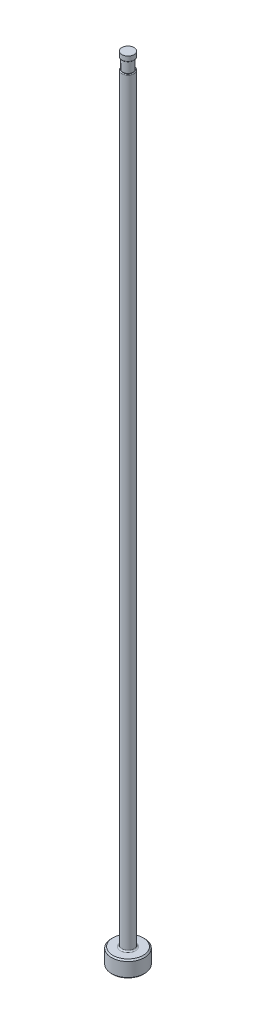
ISO-10303-21;
HEADER;
FILE_DESCRIPTION(('STEP AP214'),'2;1');
FILE_NAME('part.step','',(''),(''),'','','');
FILE_SCHEMA(('AUTOMOTIVE_DESIGN { 1 0 10303 214 1 1 1 1 }'));
ENDSEC;
DATA;
#1=APPLICATION_CONTEXT('core data for automotive mechanical design processes');
#2=APPLICATION_PROTOCOL_DEFINITION('international standard','automotive_design',2000,#1);
#3=PRODUCT_CONTEXT('',#1,'mechanical');
#4=PRODUCT('Part','Part','',(#3));
#5=PRODUCT_RELATED_PRODUCT_CATEGORY('part','',(#4));
#6=PRODUCT_DEFINITION_FORMATION('','',#4);
#7=PRODUCT_DEFINITION_CONTEXT('part definition',#1,'design');
#8=PRODUCT_DEFINITION('design','',#6,#7);
#9=PRODUCT_DEFINITION_SHAPE('','',#8);
#10=(LENGTH_UNIT() NAMED_UNIT(*) SI_UNIT(.MILLI.,.METRE.));
#11=(NAMED_UNIT(*) PLANE_ANGLE_UNIT() SI_UNIT($,.RADIAN.));
#12=(NAMED_UNIT(*) SI_UNIT($,.STERADIAN.) SOLID_ANGLE_UNIT());
#13=UNCERTAINTY_MEASURE_WITH_UNIT(LENGTH_MEASURE(1.E-05),#10,'distance_accuracy_value','');
#14=(GEOMETRIC_REPRESENTATION_CONTEXT(3) GLOBAL_UNCERTAINTY_ASSIGNED_CONTEXT((#13)) GLOBAL_UNIT_ASSIGNED_CONTEXT((#10,
#11,#12)) REPRESENTATION_CONTEXT('',''));
#15=CARTESIAN_POINT('',(0.,0.,0.));
#16=DIRECTION('',(0.,0.,1.));
#17=DIRECTION('',(1.,0.,0.));
#18=AXIS2_PLACEMENT_3D('',#15,#16,#17);
#19=CARTESIAN_POINT('',(-1.18998999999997,151.384,0.));
#20=DIRECTION('',(0.,1.,0.));
#21=DIRECTION('',(0.,0.,1.));
#22=AXIS2_PLACEMENT_3D('',#19,#20,#21);
#23=PLANE('',#22);
#24=CARTESIAN_POINT('',(0.,151.384,0.));
#25=DIRECTION('',(0.,1.,0.));
#26=DIRECTION('',(0.,0.,1.));
#27=AXIS2_PLACEMENT_3D('',#24,#25,#26);
#28=CIRCLE('',#27,1.05790999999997);
#29=CARTESIAN_POINT('',(0.,151.384,1.05790999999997));
#30=VERTEX_POINT('',#29);
#31=EDGE_CURVE('E11',#30,#30,#28,.F.);
#32=ORIENTED_EDGE('',*,*,#31,.T.);
#33=EDGE_LOOP('',(#32));
#34=FACE_BOUND('',#33,.T.);
#35=CARTESIAN_POINT('',(0.,151.384,0.));
#36=DIRECTION('',(0.,1.,0.));
#37=DIRECTION('',(0.,0.,1.));
#38=AXIS2_PLACEMENT_3D('',#35,#36,#37);
#39=CIRCLE('',#38,0.986789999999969);
#40=CARTESIAN_POINT('',(0.,151.384,0.986789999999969));
#41=VERTEX_POINT('',#40);
#42=EDGE_CURVE('E78',#41,#41,#39,.T.);
#43=ORIENTED_EDGE('',*,*,#42,.T.);
#44=EDGE_LOOP('',(#43));
#45=FACE_BOUND('',#44,.T.);
#46=ADVANCED_FACE('F36',(#34,#45),#23,.F.);
#47=CARTESIAN_POINT('',(0.,259.958771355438,0.));
#48=DIRECTION('',(0.,1.,0.));
#49=DIRECTION('',(0.,0.,1.));
#50=AXIS2_PLACEMENT_3D('',#47,#48,#49);
#51=CYLINDRICAL_SURFACE('',#50,1.18998999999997);
#52=DIRECTION('',(0.,1.,0.));
#53=VECTOR('',#52,1.);
#54=CARTESIAN_POINT('',(-0.986789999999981,259.958771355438,-0.665072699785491));
#55=LINE('',#54,#53);
#56=CARTESIAN_POINT('',(-0.986789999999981,149.225,-0.665072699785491));
#57=VERTEX_POINT('',#56);
#58=CARTESIAN_POINT('',(-0.986789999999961,86.868,-0.665072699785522));
#59=VERTEX_POINT('',#58);
#60=EDGE_CURVE('E73',#57,#59,#55,.F.);
#61=ORIENTED_EDGE('',*,*,#60,.F.);
#62=CARTESIAN_POINT('',(0.,149.225,0.));
#63=DIRECTION('',(0.,-1.,0.));
#64=DIRECTION('',(0.,0.,-1.));
#65=AXIS2_PLACEMENT_3D('',#62,#63,#64);
#66=CIRCLE('',#65,1.18998999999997);
#67=CARTESIAN_POINT('',(-0.986789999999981,149.225,0.665072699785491));
#68=VERTEX_POINT('',#67);
#69=EDGE_CURVE('E51',#57,#68,#66,.T.);
#70=ORIENTED_EDGE('',*,*,#69,.T.);
#71=DIRECTION('',(0.,1.,0.));
#72=VECTOR('',#71,1.);
#73=CARTESIAN_POINT('',(-0.986789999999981,259.958771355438,0.665072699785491));
#74=LINE('',#73,#72);
#75=CARTESIAN_POINT('',(-0.986789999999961,86.868,0.665072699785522));
#76=VERTEX_POINT('',#75);
#77=EDGE_CURVE('E84',#76,#68,#74,.T.);
#78=ORIENTED_EDGE('',*,*,#77,.F.);
#79=CARTESIAN_POINT('',(-0.98678999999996,86.868,-0.665072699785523));
#80=CARTESIAN_POINT('',(-0.986779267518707,86.817745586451,-0.66504129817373));
#81=CARTESIAN_POINT('',(-0.987982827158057,86.7674764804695,-0.663300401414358));
#82=CARTESIAN_POINT('',(-0.992752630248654,86.6671549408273,-0.656166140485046));
#83=CARTESIAN_POINT('',(-0.996326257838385,86.6171036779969,-0.650761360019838));
#84=CARTESIAN_POINT('',(-1.00583006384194,86.5171462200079,-0.635968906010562));
#85=CARTESIAN_POINT('',(-1.01178989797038,86.4672501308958,-0.626531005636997));
#86=CARTESIAN_POINT('',(-1.02587369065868,86.3688860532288,-0.603197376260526));
#87=CARTESIAN_POINT('',(-1.03399424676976,86.3204159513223,-0.589308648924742));
#88=CARTESIAN_POINT('',(-1.05174573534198,86.2273689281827,-0.556987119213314));
#89=CARTESIAN_POINT('',(-1.06130874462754,86.1827141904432,-0.538743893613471));
#90=CARTESIAN_POINT('',(-1.08163376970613,86.0965015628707,-0.496679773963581));
#91=CARTESIAN_POINT('',(-1.09239187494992,86.0549342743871,-0.472876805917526));
#92=CARTESIAN_POINT('',(-1.11191043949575,85.9848889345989,-0.424562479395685));
#93=CARTESIAN_POINT('',(-1.12059949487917,85.9555247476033,-0.401318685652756));
#94=CARTESIAN_POINT('',(-1.13756139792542,85.9007968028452,-0.350355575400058));
#95=CARTESIAN_POINT('',(-1.1458348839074,85.8754267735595,-0.322643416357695));
#96=CARTESIAN_POINT('',(-1.15898696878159,85.8364463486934,-0.270798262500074));
#97=CARTESIAN_POINT('',(-1.16417674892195,85.8215145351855,-0.24774326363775));
#98=CARTESIAN_POINT('',(-1.17342649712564,85.7953860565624,-0.199376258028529));
#99=CARTESIAN_POINT('',(-1.17748715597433,85.7841871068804,-0.174065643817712));
#100=CARTESIAN_POINT('',(-1.18407630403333,85.7662102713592,-0.121438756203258));
#101=CARTESIAN_POINT('',(-1.18659047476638,85.7594736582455,-0.0941062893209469));
#102=CARTESIAN_POINT('',(-1.18968900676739,85.7511911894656,-0.0385610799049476));
#103=CARTESIAN_POINT('',(-1.19027509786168,85.7496406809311,-0.0103491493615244));
#104=CARTESIAN_POINT('',(-1.18949770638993,85.7517102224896,0.0419738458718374));
#105=CARTESIAN_POINT('',(-1.18838954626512,85.7546530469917,0.0661187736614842));
#106=CARTESIAN_POINT('',(-1.18479997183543,85.7642873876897,0.113537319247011));
#107=CARTESIAN_POINT('',(-1.1823183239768,85.7709795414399,0.136810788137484));
#108=CARTESIAN_POINT('',(-1.17619659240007,85.787751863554,0.182112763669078));
#109=CARTESIAN_POINT('',(-1.17254841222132,85.7978557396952,0.204131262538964));
#110=CARTESIAN_POINT('',(-1.16439345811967,85.8209140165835,0.246432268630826));
#111=CARTESIAN_POINT('',(-1.15988634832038,85.8338695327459,0.266714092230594));
#112=CARTESIAN_POINT('',(-1.14755888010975,85.8702124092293,0.316494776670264));
#113=CARTESIAN_POINT('',(-1.1393180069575,85.8953279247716,0.344629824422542));
#114=CARTESIAN_POINT('',(-1.12235845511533,85.9496867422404,0.396399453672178));
#115=CARTESIAN_POINT('',(-1.11363866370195,85.9789399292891,0.420022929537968));
#116=CARTESIAN_POINT('',(-1.09186647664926,86.0564930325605,0.47452003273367));
#117=CARTESIAN_POINT('',(-1.07894485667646,86.1067247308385,0.502681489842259));
#118=CARTESIAN_POINT('',(-1.05496207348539,86.211372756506,0.55123785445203));
#119=CARTESIAN_POINT('',(-1.04391025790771,86.2658082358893,0.571594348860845));
#120=CARTESIAN_POINT('',(-1.02648158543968,86.3655321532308,0.602203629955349));
#121=CARTESIAN_POINT('',(-1.01961050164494,86.410371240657,0.613676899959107));
#122=CARTESIAN_POINT('',(-1.00772789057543,86.5011036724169,0.633000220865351));
#123=CARTESIAN_POINT('',(-1.00271814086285,86.5469979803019,0.640846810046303));
#124=CARTESIAN_POINT('',(-0.99475556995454,86.638656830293,0.653140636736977));
#125=CARTESIAN_POINT('',(-0.991771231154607,86.6844117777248,0.657640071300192));
#126=CARTESIAN_POINT('',(-0.987786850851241,86.7761143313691,0.663592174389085));
#127=CARTESIAN_POINT('',(-0.986782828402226,86.8220613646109,0.665050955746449));
#128=CARTESIAN_POINT('',(-0.98678999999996,86.868,0.665072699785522));
#129=B_SPLINE_CURVE_WITH_KNOTS('',3,(#79,#80,#81,#82,#83,#84,#85,#86,#87,#88,#89,#90,#91,#92,
#93,#94,#95,#96,#97,#98,#99,#100,#101,#102,#103,#104,#105,#106,#107,#108,#109,#110,#111,#112,
#113,#114,#115,#116,#117,#118,#119,#120,#121,#122,#123,#124,#125,#126,#127,#128),.UNSPECIFIED.,
.F.,.F.,(4,2,2,2,2,2,2,2,2,2,2,2,2,2,2,2,2,2,2,2,2,2,2,2,4),(0.,0.150742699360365,
0.301957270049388,0.455112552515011,0.608028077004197,0.75521904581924,0.901941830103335,
1.01691912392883,1.13171404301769,1.21527204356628,1.29877881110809,1.3830475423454,
1.46724064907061,1.53993547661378,1.61264266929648,1.68586586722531,1.75911775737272,
1.8742700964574,1.98970233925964,2.16578434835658,2.34272217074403,2.48289840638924,
2.62320816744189,2.7612811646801,2.8990763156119),.UNSPECIFIED.);
#130=EDGE_CURVE('E81',#59,#76,#129,.T.);
#131=ORIENTED_EDGE('',*,*,#130,.F.);
#132=EDGE_LOOP('',(#61,#70,#78,#131));
#133=FACE_BOUND('',#132,.T.);
#134=CARTESIAN_POINT('',(0.,3.42900000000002,0.));
#135=DIRECTION('',(0.,1.,0.));
#136=DIRECTION('',(0.,0.,1.));
#137=AXIS2_PLACEMENT_3D('',#134,#135,#136);
#138=CIRCLE('',#137,1.18998999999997);
#139=CARTESIAN_POINT('',(0.,3.42900000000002,1.18998999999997));
#140=VERTEX_POINT('',#139);
#141=EDGE_CURVE('E116',#140,#140,#138,.T.);
#142=ORIENTED_EDGE('',*,*,#141,.T.);
#143=EDGE_LOOP('',(#142));
#144=FACE_BOUND('',#143,.T.);
#145=ADVANCED_FACE('F82',(#133,#144),#51,.T.);
#146=CARTESIAN_POINT('',(0.,0.,0.));
#147=DIRECTION('',(0.,-1.,0.));
#148=DIRECTION('',(0.,0.,-1.));
#149=AXIS2_PLACEMENT_3D('',#146,#147,#148);
#150=PLANE('',#149);
#151=CARTESIAN_POINT('',(0.,0.,0.));
#152=DIRECTION('',(0.,-1.,0.));
#153=DIRECTION('',(0.,0.,-1.));
#154=AXIS2_PLACEMENT_3D('',#151,#152,#153);
#155=CIRCLE('',#154,2.92099999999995);
#156=CARTESIAN_POINT('',(0.,0.,-2.92099999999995));
#157=VERTEX_POINT('',#156);
#158=EDGE_CURVE('E113',#157,#157,#155,.T.);
#159=ORIENTED_EDGE('',*,*,#158,.T.);
#160=EDGE_LOOP('',(#159));
#161=FACE_BOUND('',#160,.T.);
#162=ADVANCED_FACE('F192',(#161),#150,.T.);
#163=CARTESIAN_POINT('',(0.,259.958771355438,0.));
#164=DIRECTION('',(0.,1.,0.));
#165=DIRECTION('',(0.,0.,1.));
#166=AXIS2_PLACEMENT_3D('',#163,#164,#165);
#167=CYLINDRICAL_SURFACE('',#166,3.17499999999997);
#168=CARTESIAN_POINT('',(0.,2.92100000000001,0.));
#169=DIRECTION('',(0.,1.,0.));
#170=DIRECTION('',(0.,0.,1.));
#171=AXIS2_PLACEMENT_3D('',#168,#169,#170);
#172=CIRCLE('',#171,3.17499999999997);
#173=CARTESIAN_POINT('',(0.,2.92100000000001,3.17499999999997));
#174=VERTEX_POINT('',#173);
#175=EDGE_CURVE('E110',#174,#174,#172,.F.);
#176=ORIENTED_EDGE('',*,*,#175,.T.);
#177=EDGE_LOOP('',(#176));
#178=FACE_BOUND('',#177,.T.);
#179=CARTESIAN_POINT('',(0.,0.254000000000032,0.));
#180=DIRECTION('',(0.,-1.,0.));
#181=DIRECTION('',(0.,0.,-1.));
#182=AXIS2_PLACEMENT_3D('',#179,#180,#181);
#183=CIRCLE('',#182,3.17499999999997);
#184=CARTESIAN_POINT('',(0.,0.254000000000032,-3.17499999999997));
#185=VERTEX_POINT('',#184);
#186=EDGE_CURVE('E107',#185,#185,#183,.F.);
#187=ORIENTED_EDGE('',*,*,#186,.T.);
#188=EDGE_LOOP('',(#187));
#189=FACE_BOUND('',#188,.T.);
#190=ADVANCED_FACE('F195',(#178,#189),#167,.T.);
#191=CARTESIAN_POINT('',(-3.17499999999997,3.175,0.));
#192=DIRECTION('',(0.,1.,0.));
#193=DIRECTION('',(0.,0.,1.));
#194=AXIS2_PLACEMENT_3D('',#191,#192,#193);
#195=PLANE('',#194);
#196=CARTESIAN_POINT('',(0.,3.175,0.));
#197=DIRECTION('',(0.,1.,0.));
#198=DIRECTION('',(0.,0.,1.));
#199=AXIS2_PLACEMENT_3D('',#196,#197,#198);
#200=CIRCLE('',#199,1.44398999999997);
#201=CARTESIAN_POINT('',(0.,3.175,1.44398999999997));
#202=VERTEX_POINT('',#201);
#203=EDGE_CURVE('E87',#202,#202,#200,.F.);
#204=ORIENTED_EDGE('',*,*,#203,.T.);
#205=EDGE_LOOP('',(#204));
#206=FACE_BOUND('',#205,.T.);
#207=CARTESIAN_POINT('',(0.,3.175,0.));
#208=DIRECTION('',(0.,1.,0.));
#209=DIRECTION('',(0.,0.,1.));
#210=AXIS2_PLACEMENT_3D('',#207,#208,#209);
#211=CIRCLE('',#210,2.92099999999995);
#212=CARTESIAN_POINT('',(0.,3.175,2.92099999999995));
#213=VERTEX_POINT('',#212);
#214=EDGE_CURVE('E104',#213,#213,#211,.T.);
#215=ORIENTED_EDGE('',*,*,#214,.T.);
#216=EDGE_LOOP('',(#215));
#217=FACE_BOUND('',#216,.T.);
#218=ADVANCED_FACE('F190',(#206,#217),#195,.T.);
#219=CARTESIAN_POINT('',(0.,3.17499999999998,0.));
#220=DIRECTION('',(0.,-1.,0.));
#221=DIRECTION('',(0.,0.,-1.));
#222=AXIS2_PLACEMENT_3D('',#219,#220,#221);
#223=CONICAL_SURFACE('',#222,2.92099999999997,0.7853981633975);
#224=ORIENTED_EDGE('',*,*,#175,.F.);
#225=EDGE_LOOP('',(#224));
#226=FACE_BOUND('',#225,.T.);
#227=ORIENTED_EDGE('',*,*,#214,.F.);
#228=EDGE_LOOP('',(#227));
#229=FACE_BOUND('',#228,.T.);
#230=ADVANCED_FACE('F186',(#226,#229),#223,.T.);
#231=CARTESIAN_POINT('',(0.,0.254000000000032,0.));
#232=DIRECTION('',(0.,1.,0.));
#233=DIRECTION('',(0.,0.,1.));
#234=AXIS2_PLACEMENT_3D('',#231,#232,#233);
#235=CONICAL_SURFACE('',#234,3.17499999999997,0.785398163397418);
#236=ORIENTED_EDGE('',*,*,#158,.F.);
#237=EDGE_LOOP('',(#236));
#238=FACE_BOUND('',#237,.T.);
#239=ORIENTED_EDGE('',*,*,#186,.F.);
#240=EDGE_LOOP('',(#239));
#241=FACE_BOUND('',#240,.T.);
#242=ADVANCED_FACE('F182',(#238,#241),#235,.T.);
#243=CARTESIAN_POINT('',(0.,3.42900000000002,0.));
#244=DIRECTION('',(0.,1.,0.));
#245=DIRECTION('',(0.,0.,1.));
#246=AXIS2_PLACEMENT_3D('',#243,#244,#245);
#247=TOROIDAL_SURFACE('',#246,1.44398999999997,0.254);
#248=ORIENTED_EDGE('',*,*,#203,.F.);
#249=EDGE_LOOP('',(#248));
#250=FACE_BOUND('',#249,.T.);
#251=ORIENTED_EDGE('',*,*,#141,.F.);
#252=EDGE_LOOP('',(#251));
#253=FACE_BOUND('',#252,.T.);
#254=ADVANCED_FACE('F147',(#250,#253),#247,.F.);
#255=CARTESIAN_POINT('',(-1.18998999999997,149.352,0.));
#256=DIRECTION('',(0.,-1.,0.));
#257=DIRECTION('',(0.,0.,-1.));
#258=AXIS2_PLACEMENT_3D('',#255,#256,#257);
#259=PLANE('',#258);
#260=DIRECTION('',(0.,0.,1.));
#261=VECTOR('',#260,1.);
#262=CARTESIAN_POINT('',(-0.986789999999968,149.352,0.));
#263=LINE('',#262,#261);
#264=CARTESIAN_POINT('',(-0.986789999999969,149.352,0.));
#265=VERTEX_POINT('',#264);
#266=CARTESIAN_POINT('',(-0.986789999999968,149.352,0.39521289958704));
#267=VERTEX_POINT('',#266);
#268=EDGE_CURVE('E90',#265,#267,#263,.T.);
#269=ORIENTED_EDGE('',*,*,#268,.T.);
#270=CARTESIAN_POINT('',(0.,149.352,0.));
#271=DIRECTION('',(0.,-1.,0.));
#272=DIRECTION('',(0.,0.,-1.));
#273=AXIS2_PLACEMENT_3D('',#270,#271,#272);
#274=CIRCLE('',#273,1.06298999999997);
#275=CARTESIAN_POINT('',(-0.986789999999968,149.352,-0.39521289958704));
#276=VERTEX_POINT('',#275);
#277=EDGE_CURVE('E86',#267,#276,#274,.F.);
#278=ORIENTED_EDGE('',*,*,#277,.T.);
#279=EDGE_CURVE('E79',#276,#265,#263,.T.);
#280=ORIENTED_EDGE('',*,*,#279,.T.);
#281=CARTESIAN_POINT('',(0.,149.352,0.));
#282=DIRECTION('',(0.,1.,0.));
#283=DIRECTION('',(0.,0.,1.));
#284=AXIS2_PLACEMENT_3D('',#281,#282,#283);
#285=CIRCLE('',#284,0.986789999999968);
#286=EDGE_CURVE('E101',#265,#265,#285,.T.);
#287=ORIENTED_EDGE('',*,*,#286,.F.);
#288=EDGE_LOOP('',(#269,#278,#280,#287));
#289=FACE_BOUND('',#288,.T.);
#290=ADVANCED_FACE('F144',(#289),#259,.F.);
#291=CARTESIAN_POINT('',(0.,153.448281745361,0.));
#292=DIRECTION('',(0.,1.,0.));
#293=DIRECTION('',(0.,0.,1.));
#294=AXIS2_PLACEMENT_3D('',#291,#292,#293);
#295=CYLINDRICAL_SURFACE('',#294,0.986789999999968);
#296=ORIENTED_EDGE('',*,*,#42,.F.);
#297=EDGE_LOOP('',(#296));
#298=FACE_BOUND('',#297,.T.);
#299=ORIENTED_EDGE('',*,*,#286,.T.);
#300=EDGE_LOOP('',(#299));
#301=FACE_BOUND('',#300,.T.);
#302=ADVANCED_FACE('F141',(#298,#301),#295,.T.);
#303=CARTESIAN_POINT('',(-0.986789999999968,150.368,-3.17499999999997));
#304=DIRECTION('',(1.,0.,0.));
#305=DIRECTION('',(0.,1.,0.));
#306=AXIS2_PLACEMENT_3D('',#303,#304,#305);
#307=PLANE('',#306);
#308=ORIENTED_EDGE('',*,*,#279,.F.);
#309=CARTESIAN_POINT('',(-0.986789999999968,149.352,-0.39521289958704));
#310=CARTESIAN_POINT('',(-0.986789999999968,149.351995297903,-0.407444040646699));
#311=CARTESIAN_POINT('',(-0.986789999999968,149.351755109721,-0.419683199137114));
#312=CARTESIAN_POINT('',(-0.986789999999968,149.350653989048,-0.444183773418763));
#313=CARTESIAN_POINT('',(-0.986789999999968,149.349790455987,-0.456445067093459));
#314=CARTESIAN_POINT('',(-0.986789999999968,149.347278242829,-0.481011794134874));
#315=CARTESIAN_POINT('',(-0.986789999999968,149.345621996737,-0.493316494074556));
#316=CARTESIAN_POINT('',(-0.986789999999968,149.341322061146,-0.517737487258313));
#317=CARTESIAN_POINT('',(-0.986789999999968,149.338680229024,-0.529854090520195));
#318=CARTESIAN_POINT('',(-0.986789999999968,149.333166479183,-0.550007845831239));
#319=CARTESIAN_POINT('',(-0.986789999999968,149.330625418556,-0.558134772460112));
#320=CARTESIAN_POINT('',(-0.986789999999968,149.324838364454,-0.574135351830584));
#321=CARTESIAN_POINT('',(-0.986789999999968,149.32159268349,-0.582009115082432));
#322=CARTESIAN_POINT('',(-0.986789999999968,149.314227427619,-0.597422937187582));
#323=CARTESIAN_POINT('',(-0.986789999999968,149.31010093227,-0.604959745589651));
#324=CARTESIAN_POINT('',(-0.986789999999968,149.30081754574,-0.619377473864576));
#325=CARTESIAN_POINT('',(-0.986789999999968,149.295662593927,-0.626259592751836));
#326=CARTESIAN_POINT('',(-0.986789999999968,149.286322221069,-0.636549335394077));
#327=CARTESIAN_POINT('',(-0.986789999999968,149.282503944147,-0.640288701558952));
#328=CARTESIAN_POINT('',(-0.986789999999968,149.274372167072,-0.64719107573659));
#329=CARTESIAN_POINT('',(-0.986789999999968,149.27005907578,-0.650354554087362));
#330=CARTESIAN_POINT('',(-0.986789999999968,149.261638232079,-0.655489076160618));
#331=CARTESIAN_POINT('',(-0.986789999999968,149.257596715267,-0.657567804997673));
#332=CARTESIAN_POINT('',(-0.986789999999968,149.249227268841,-0.661024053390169));
#333=CARTESIAN_POINT('',(-0.986789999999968,149.24490005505,-0.662403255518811));
#334=CARTESIAN_POINT('',(-0.986789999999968,149.23794708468,-0.663934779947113));
#335=CARTESIAN_POINT('',(-0.986789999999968,149.235379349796,-0.664359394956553));
#336=CARTESIAN_POINT('',(-0.986789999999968,149.230208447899,-0.664929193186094));
#337=CARTESIAN_POINT('',(-0.986789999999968,149.227605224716,-0.665073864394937));
#338=CARTESIAN_POINT('',(-0.986789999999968,149.225000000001,-0.665072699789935));
#339=B_SPLINE_CURVE_WITH_KNOTS('',3,(#309,#310,#311,#312,#313,#314,#315,#316,#317,#318,#319,
#320,#321,#322,#323,#324,#325,#326,#327,#328,#329,#330,#331,#332,#333,#334,#335,#336,#337,#338),
.UNSPECIFIED.,.F.,.F.,(4,2,2,2,2,2,2,2,2,2,2,2,2,2,4),(0.,0.0367035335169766,0.073561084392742,
0.110777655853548,0.147924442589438,0.173443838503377,0.198951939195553,0.224668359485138,
0.250336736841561,0.266328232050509,0.282306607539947,0.29588834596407,0.309437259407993,
0.317231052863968,0.325039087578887),.UNSPECIFIED.);
#340=EDGE_CURVE('E59',#276,#57,#339,.T.);
#341=ORIENTED_EDGE('',*,*,#340,.T.);
#342=ORIENTED_EDGE('',*,*,#60,.T.);
#343=DIRECTION('',(0.,0.,1.));
#344=VECTOR('',#343,1.);
#345=CARTESIAN_POINT('',(-0.986789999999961,86.868,-3.17499999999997));
#346=LINE('',#345,#344);
#347=EDGE_CURVE('E77',#59,#76,#346,.T.);
#348=ORIENTED_EDGE('',*,*,#347,.T.);
#349=ORIENTED_EDGE('',*,*,#77,.T.);
#350=CARTESIAN_POINT('',(-0.986789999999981,149.225,0.665072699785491));
#351=CARTESIAN_POINT('',(-0.986789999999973,149.229976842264,0.665089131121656));
#352=CARTESIAN_POINT('',(-0.986789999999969,149.234932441,0.664550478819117));
#353=CARTESIAN_POINT('',(-0.986789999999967,149.244580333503,0.66251429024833));
#354=CARTESIAN_POINT('',(-0.986789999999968,149.249275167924,0.661028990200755));
#355=CARTESIAN_POINT('',(-0.986789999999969,149.258292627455,0.65725339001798));
#356=CARTESIAN_POINT('',(-0.986789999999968,149.26261696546,0.654967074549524));
#357=CARTESIAN_POINT('',(-0.986789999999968,149.270874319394,0.649756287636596));
#358=CARTESIAN_POINT('',(-0.986789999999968,149.27480595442,0.646829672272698));
#359=CARTESIAN_POINT('',(-0.986789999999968,149.284276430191,0.638773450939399));
#360=CARTESIAN_POINT('',(-0.986789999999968,149.289529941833,0.633310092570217));
#361=CARTESIAN_POINT('',(-0.986789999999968,149.299132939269,0.621650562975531));
#362=CARTESIAN_POINT('',(-0.986789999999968,149.303480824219,0.615453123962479));
#363=CARTESIAN_POINT('',(-0.986789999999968,149.314260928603,0.597941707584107));
#364=CARTESIAN_POINT('',(-0.986789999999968,149.319932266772,0.586163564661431));
#365=CARTESIAN_POINT('',(-0.986789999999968,149.329557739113,0.561881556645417));
#366=CARTESIAN_POINT('',(-0.986789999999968,149.333500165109,0.54937337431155));
#367=CARTESIAN_POINT('',(-0.986789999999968,149.339776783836,0.525021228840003));
#368=CARTESIAN_POINT('',(-0.986789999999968,149.342213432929,0.513202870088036));
#369=CARTESIAN_POINT('',(-0.986789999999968,149.346177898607,0.489402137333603));
#370=CARTESIAN_POINT('',(-0.986789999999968,149.347704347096,0.477419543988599));
#371=CARTESIAN_POINT('',(-0.986789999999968,149.349993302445,0.453722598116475));
#372=CARTESIAN_POINT('',(-0.986789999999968,149.350775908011,0.442010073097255));
#373=CARTESIAN_POINT('',(-0.986789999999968,149.351776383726,0.418600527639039));
#374=CARTESIAN_POINT('',(-0.986789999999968,149.351996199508,0.406903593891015));
#375=CARTESIAN_POINT('',(-0.986789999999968,149.352,0.395212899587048));
#376=B_SPLINE_CURVE_WITH_KNOTS('',3,(#350,#351,#352,#353,#354,#355,#356,#357,#358,#359,#360,
#361,#362,#363,#364,#365,#366,#367,#368,#369,#370,#371,#372,#373,#374,#375),.UNSPECIFIED.,.F.,
.F.,(4,2,2,2,2,2,2,2,2,2,2,2,4),(0.,0.0148678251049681,0.0295472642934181,0.0441546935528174,
0.0588118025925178,0.0814211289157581,0.104070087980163,0.143067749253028,0.182325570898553,
0.218481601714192,0.254691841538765,0.289893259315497,0.32497281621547),.UNSPECIFIED.);
#377=EDGE_CURVE('E172',#68,#267,#376,.T.);
#378=ORIENTED_EDGE('',*,*,#377,.T.);
#379=ORIENTED_EDGE('',*,*,#268,.F.);
#380=EDGE_LOOP('',(#308,#341,#342,#348,#349,#378,#379));
#381=FACE_BOUND('',#380,.T.);
#382=ADVANCED_FACE('F75',(#381),#307,.F.);
#383=CARTESIAN_POINT('',(-4.16178999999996,86.868,-3.17499999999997));
#384=DIRECTION('',(0.,0.,1.));
#385=DIRECTION('',(1.,0.,0.));
#386=AXIS2_PLACEMENT_3D('',#383,#384,#385);
#387=CYLINDRICAL_SURFACE('',#386,3.175);
#388=ORIENTED_EDGE('',*,*,#347,.F.);
#389=ORIENTED_EDGE('',*,*,#130,.T.);
#390=EDGE_LOOP('',(#388,#389));
#391=FACE_BOUND('',#390,.T.);
#392=ADVANCED_FACE('F89',(#391),#387,.F.);
#393=CARTESIAN_POINT('',(0.,152.687735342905,0.));
#394=DIRECTION('',(0.,1.,0.));
#395=DIRECTION('',(0.,0.,1.));
#396=AXIS2_PLACEMENT_3D('',#393,#394,#395);
#397=CYLINDRICAL_SURFACE('',#396,1.18490999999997);
#398=CARTESIAN_POINT('',(0.,151.511,0.));
#399=DIRECTION('',(0.,1.,0.));
#400=DIRECTION('',(0.,0.,1.));
#401=AXIS2_PLACEMENT_3D('',#398,#399,#400);
#402=CIRCLE('',#401,1.18490999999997);
#403=CARTESIAN_POINT('',(0.,151.511,1.18490999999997));
#404=VERTEX_POINT('',#403);
#405=EDGE_CURVE('E44',#404,#404,#402,.T.);
#406=ORIENTED_EDGE('',*,*,#405,.T.);
#407=EDGE_LOOP('',(#406));
#408=FACE_BOUND('',#407,.T.);
#409=CARTESIAN_POINT('',(0.,152.4,0.));
#410=DIRECTION('',(0.,1.,0.));
#411=DIRECTION('',(0.,0.,1.));
#412=AXIS2_PLACEMENT_3D('',#409,#410,#411);
#413=CIRCLE('',#412,1.18490999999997);
#414=CARTESIAN_POINT('',(0.,152.4,1.18490999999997));
#415=VERTEX_POINT('',#414);
#416=EDGE_CURVE('E91',#415,#415,#413,.T.);
#417=ORIENTED_EDGE('',*,*,#416,.F.);
#418=EDGE_LOOP('',(#417));
#419=FACE_BOUND('',#418,.T.);
#420=ADVANCED_FACE('F135',(#408,#419),#397,.T.);
#421=CARTESIAN_POINT('',(-1.18998999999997,152.4,0.));
#422=DIRECTION('',(0.,1.,0.));
#423=DIRECTION('',(0.,0.,1.));
#424=AXIS2_PLACEMENT_3D('',#421,#422,#423);
#425=PLANE('',#424);
#426=ORIENTED_EDGE('',*,*,#416,.T.);
#427=EDGE_LOOP('',(#426));
#428=FACE_BOUND('',#427,.T.);
#429=ADVANCED_FACE('F149',(#428),#425,.T.);
#430=CARTESIAN_POINT('',(0.,149.225,0.));
#431=DIRECTION('',(0.,-1.,0.));
#432=DIRECTION('',(0.,0.,-1.));
#433=AXIS2_PLACEMENT_3D('',#430,#431,#432);
#434=TOROIDAL_SURFACE('',#433,1.06298999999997,0.127);
#435=ORIENTED_EDGE('',*,*,#377,.F.);
#436=ORIENTED_EDGE('',*,*,#69,.F.);
#437=ORIENTED_EDGE('',*,*,#340,.F.);
#438=ORIENTED_EDGE('',*,*,#277,.F.);
#439=EDGE_LOOP('',(#435,#436,#437,#438));
#440=FACE_BOUND('',#439,.T.);
#441=ADVANCED_FACE('F151',(#440),#434,.T.);
#442=CARTESIAN_POINT('',(0.,151.511,0.));
#443=DIRECTION('',(0.,1.,0.));
#444=DIRECTION('',(0.,0.,1.));
#445=AXIS2_PLACEMENT_3D('',#442,#443,#444);
#446=TOROIDAL_SURFACE('',#445,1.05790999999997,0.127);
#447=ORIENTED_EDGE('',*,*,#31,.F.);
#448=EDGE_LOOP('',(#447));
#449=FACE_BOUND('',#448,.T.);
#450=ORIENTED_EDGE('',*,*,#405,.F.);
#451=EDGE_LOOP('',(#450));
#452=FACE_BOUND('',#451,.T.);
#453=ADVANCED_FACE('F38',(#449,#452),#446,.T.);
#454=CLOSED_SHELL('',(#46,#145,#162,#190,#218,#230,#242,#254,#290,#302,#382,#392,#420,#429,#441,#453));
#455=MANIFOLD_SOLID_BREP('B2',#454);
#456=ADVANCED_BREP_SHAPE_REPRESENTATION('',(#18,#455),#14);
#457=SHAPE_DEFINITION_REPRESENTATION(#9,#456);
ENDSEC;
END-ISO-10303-21;
